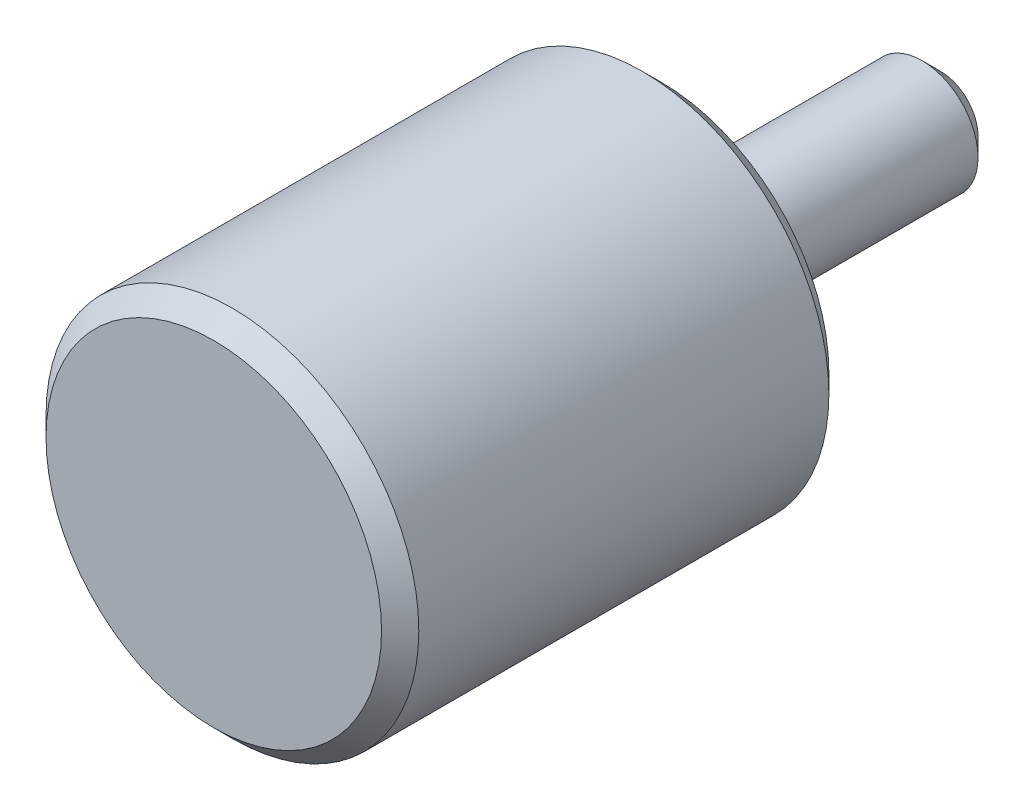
ISO-10303-21;
HEADER;
FILE_DESCRIPTION(('STEP AP214'),'2;1');
FILE_NAME('part.step','',(''),(''),'','','');
FILE_SCHEMA(('AUTOMOTIVE_DESIGN { 1 0 10303 214 1 1 1 1 }'));
ENDSEC;
DATA;
#1=APPLICATION_CONTEXT('core data for automotive mechanical design processes');
#2=APPLICATION_PROTOCOL_DEFINITION('international standard','automotive_design',2000,#1);
#3=PRODUCT_CONTEXT('',#1,'mechanical');
#4=PRODUCT('Part','Part','',(#3));
#5=PRODUCT_RELATED_PRODUCT_CATEGORY('part','',(#4));
#6=PRODUCT_DEFINITION_FORMATION('','',#4);
#7=PRODUCT_DEFINITION_CONTEXT('part definition',#1,'design');
#8=PRODUCT_DEFINITION('design','',#6,#7);
#9=PRODUCT_DEFINITION_SHAPE('','',#8);
#10=(LENGTH_UNIT() NAMED_UNIT(*) SI_UNIT(.MILLI.,.METRE.));
#11=(NAMED_UNIT(*) PLANE_ANGLE_UNIT() SI_UNIT($,.RADIAN.));
#12=(NAMED_UNIT(*) SI_UNIT($,.STERADIAN.) SOLID_ANGLE_UNIT());
#13=UNCERTAINTY_MEASURE_WITH_UNIT(LENGTH_MEASURE(1.E-05),#10,'distance_accuracy_value','');
#14=(GEOMETRIC_REPRESENTATION_CONTEXT(3) GLOBAL_UNCERTAINTY_ASSIGNED_CONTEXT((#13)) GLOBAL_UNIT_ASSIGNED_CONTEXT((#10,
#11,#12)) REPRESENTATION_CONTEXT('',''));
#15=CARTESIAN_POINT('',(0.,0.,0.));
#16=DIRECTION('',(0.,0.,1.));
#17=DIRECTION('',(1.,0.,0.));
#18=AXIS2_PLACEMENT_3D('',#15,#16,#17);
#19=CARTESIAN_POINT('',(0.,0.,24.));
#20=DIRECTION('',(0.,0.,-1.));
#21=DIRECTION('',(-1.,0.,0.));
#22=AXIS2_PLACEMENT_3D('',#19,#20,#21);
#23=CYLINDRICAL_SURFACE('',#22,10.);
#24=CARTESIAN_POINT('',(0.,0.,23.));
#25=DIRECTION('',(0.,0.,1.));
#26=DIRECTION('',(1.,0.,0.));
#27=AXIS2_PLACEMENT_3D('',#24,#25,#26);
#28=CIRCLE('',#27,10.);
#29=CARTESIAN_POINT('',(10.,0.,23.));
#30=VERTEX_POINT('',#29);
#31=EDGE_CURVE('E24',#30,#30,#28,.F.);
#32=ORIENTED_EDGE('',*,*,#31,.T.);
#33=EDGE_LOOP('',(#32));
#34=FACE_BOUND('',#33,.T.);
#35=CARTESIAN_POINT('',(0.,0.,1.));
#36=DIRECTION('',(0.,0.,1.));
#37=DIRECTION('',(1.,0.,0.));
#38=AXIS2_PLACEMENT_3D('',#35,#36,#37);
#39=CIRCLE('',#38,10.);
#40=CARTESIAN_POINT('',(10.,0.,1.));
#41=VERTEX_POINT('',#40);
#42=EDGE_CURVE('E35',#41,#41,#39,.T.);
#43=ORIENTED_EDGE('',*,*,#42,.T.);
#44=EDGE_LOOP('',(#43));
#45=FACE_BOUND('',#44,.T.);
#46=ADVANCED_FACE('F12',(#34,#45),#23,.T.);
#47=CARTESIAN_POINT('',(0.,0.,24.));
#48=DIRECTION('',(0.,0.,1.));
#49=DIRECTION('',(1.,0.,0.));
#50=AXIS2_PLACEMENT_3D('',#47,#48,#49);
#51=PLANE('',#50);
#52=CARTESIAN_POINT('',(0.,0.,24.));
#53=DIRECTION('',(0.,0.,1.));
#54=DIRECTION('',(1.,0.,0.));
#55=AXIS2_PLACEMENT_3D('',#52,#53,#54);
#56=CIRCLE('',#55,9.);
#57=CARTESIAN_POINT('',(9.,0.,24.));
#58=VERTEX_POINT('',#57);
#59=EDGE_CURVE('E29',#58,#58,#56,.T.);
#60=ORIENTED_EDGE('',*,*,#59,.T.);
#61=EDGE_LOOP('',(#60));
#62=FACE_BOUND('',#61,.T.);
#63=ADVANCED_FACE('F47',(#62),#51,.T.);
#64=CARTESIAN_POINT('',(0.,0.,0.));
#65=DIRECTION('',(0.,0.,1.));
#66=DIRECTION('',(1.,0.,0.));
#67=AXIS2_PLACEMENT_3D('',#64,#65,#66);
#68=PLANE('',#67);
#69=CARTESIAN_POINT('',(0.,0.,0.));
#70=DIRECTION('',(0.,0.,1.));
#71=DIRECTION('',(1.,0.,0.));
#72=AXIS2_PLACEMENT_3D('',#69,#70,#71);
#73=CIRCLE('',#72,9.);
#74=CARTESIAN_POINT('',(9.,0.,0.));
#75=VERTEX_POINT('',#74);
#76=EDGE_CURVE('E32',#75,#75,#73,.F.);
#77=ORIENTED_EDGE('',*,*,#76,.T.);
#78=EDGE_LOOP('',(#77));
#79=FACE_BOUND('',#78,.T.);
#80=CARTESIAN_POINT('',(0.,0.,0.));
#81=DIRECTION('',(0.,0.,-1.));
#82=DIRECTION('',(-1.,0.,0.));
#83=AXIS2_PLACEMENT_3D('',#80,#81,#82);
#84=CIRCLE('',#83,3.);
#85=CARTESIAN_POINT('',(-3.,0.,0.));
#86=VERTEX_POINT('',#85);
#87=EDGE_CURVE('E16',#86,#86,#84,.T.);
#88=ORIENTED_EDGE('',*,*,#87,.F.);
#89=EDGE_LOOP('',(#88));
#90=FACE_BOUND('',#89,.T.);
#91=ADVANCED_FACE('F44',(#79,#90),#68,.F.);
#92=CARTESIAN_POINT('',(0.,0.,1.));
#93=DIRECTION('',(0.,0.,1.));
#94=DIRECTION('',(1.,0.,0.));
#95=AXIS2_PLACEMENT_3D('',#92,#93,#94);
#96=CONICAL_SURFACE('',#95,10.,0.78539816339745);
#97=ORIENTED_EDGE('',*,*,#76,.F.);
#98=EDGE_LOOP('',(#97));
#99=FACE_BOUND('',#98,.T.);
#100=ORIENTED_EDGE('',*,*,#42,.F.);
#101=EDGE_LOOP('',(#100));
#102=FACE_BOUND('',#101,.T.);
#103=ADVANCED_FACE('F46',(#99,#102),#96,.T.);
#104=CARTESIAN_POINT('',(0.,0.,24.));
#105=DIRECTION('',(0.,0.,-1.));
#106=DIRECTION('',(-1.,0.,0.));
#107=AXIS2_PLACEMENT_3D('',#104,#105,#106);
#108=CONICAL_SURFACE('',#107,9.,0.785398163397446);
#109=ORIENTED_EDGE('',*,*,#31,.F.);
#110=EDGE_LOOP('',(#109));
#111=FACE_BOUND('',#110,.T.);
#112=ORIENTED_EDGE('',*,*,#59,.F.);
#113=EDGE_LOOP('',(#112));
#114=FACE_BOUND('',#113,.T.);
#115=ADVANCED_FACE('F55',(#111,#114),#108,.T.);
#116=CARTESIAN_POINT('',(0.,0.,-15.));
#117=DIRECTION('',(0.,0.,1.));
#118=DIRECTION('',(1.,0.,0.));
#119=AXIS2_PLACEMENT_3D('',#116,#117,#118);
#120=PLANE('',#119);
#121=CARTESIAN_POINT('',(0.,0.,-15.));
#122=DIRECTION('',(0.,0.,1.));
#123=DIRECTION('',(1.,0.,0.));
#124=AXIS2_PLACEMENT_3D('',#121,#122,#123);
#125=CIRCLE('',#124,2.);
#126=CARTESIAN_POINT('',(2.,0.,-15.));
#127=VERTEX_POINT('',#126);
#128=EDGE_CURVE('E8',#127,#127,#125,.F.);
#129=ORIENTED_EDGE('',*,*,#128,.T.);
#130=EDGE_LOOP('',(#129));
#131=FACE_BOUND('',#130,.T.);
#132=ADVANCED_FACE('F68',(#131),#120,.F.);
#133=CARTESIAN_POINT('',(0.,0.,-14.));
#134=DIRECTION('',(0.,0.,1.));
#135=DIRECTION('',(1.,0.,0.));
#136=AXIS2_PLACEMENT_3D('',#133,#134,#135);
#137=CONICAL_SURFACE('',#136,3.,0.78539816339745);
#138=ORIENTED_EDGE('',*,*,#128,.F.);
#139=EDGE_LOOP('',(#138));
#140=FACE_BOUND('',#139,.T.);
#141=CARTESIAN_POINT('',(0.,0.,-14.));
#142=DIRECTION('',(0.,0.,1.));
#143=DIRECTION('',(1.,0.,0.));
#144=AXIS2_PLACEMENT_3D('',#141,#142,#143);
#145=CIRCLE('',#144,3.);
#146=CARTESIAN_POINT('',(3.,0.,-14.));
#147=VERTEX_POINT('',#146);
#148=EDGE_CURVE('E20',#147,#147,#145,.T.);
#149=ORIENTED_EDGE('',*,*,#148,.F.);
#150=EDGE_LOOP('',(#149));
#151=FACE_BOUND('',#150,.T.);
#152=ADVANCED_FACE('F66',(#140,#151),#137,.T.);
#153=CARTESIAN_POINT('',(0.,0.,10.));
#154=DIRECTION('',(0.,0.,-1.));
#155=DIRECTION('',(-1.,0.,0.));
#156=AXIS2_PLACEMENT_3D('',#153,#154,#155);
#157=CYLINDRICAL_SURFACE('',#156,3.);
#158=ORIENTED_EDGE('',*,*,#87,.T.);
#159=EDGE_LOOP('',(#158));
#160=FACE_BOUND('',#159,.T.);
#161=ORIENTED_EDGE('',*,*,#148,.T.);
#162=EDGE_LOOP('',(#161));
#163=FACE_BOUND('',#162,.T.);
#164=ADVANCED_FACE('F14',(#160,#163),#157,.T.);
#165=CLOSED_SHELL('',(#46,#63,#91,#103,#115,#132,#152,#164));
#166=MANIFOLD_SOLID_BREP('B1',#165);
#167=ADVANCED_BREP_SHAPE_REPRESENTATION('',(#18,#166),#14);
#168=SHAPE_DEFINITION_REPRESENTATION(#9,#167);
ENDSEC;
END-ISO-10303-21;
